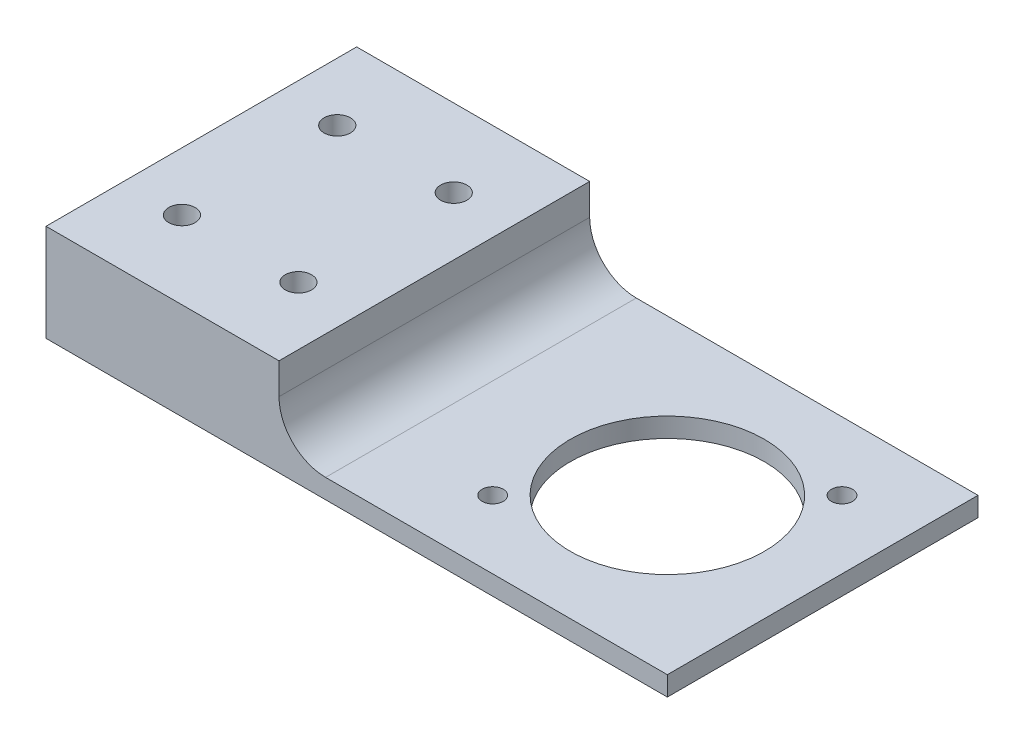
from build123d import *

# Parameters (mm, degrees)
BOSS_EXTRUDE1_DEPTH                         = 3.175
SKETCH6_W                                   = 38.1
SKETCH6_H                                   = 50.8
BOSS_EXTRUDE3_DEPTH                         = 12.7
FILLET1_R                                   = 7.62
SKETCH7_R                                   = 2.15265
CUT_EXTRUDE4_DEPTH                          = 15.875
THRUHOLEFOR1_180_BEARINGOD_REACH            = 72.21
SKETCH8_R                                   = 15.875
TAPPEDHOLEFOR8_32_BOLTMUSTBE_375_LONG_REACH = 72.21
SKETCH9_R                                   = 1.7272


with BuildPart() as part:
    # Sketch1 → Boss-Extrude1 (new body)
    with BuildSketch(Plane(origin=(0, 0, 0), x_dir=(1, 0, 0), z_dir=(0, 1, 0))):
        Polygon((50.8, 25.4), (63.5, 25.4), (63.5, -25.4), (50.8, -25.4), (0, -25.4), (-38.1, -25.4), (-38.1, 25.4), (0, 25.4), align=None)
    extrude(amount=BOSS_EXTRUDE1_DEPTH)

    # Sketch6 → Boss-Extrude3 (add)
    with BuildSketch(Plane(origin=(0, 3.175, 0), x_dir=(1, 0, 0), z_dir=(0, 1, 0))):
        with Locations((-19.05, 0)):
            Rectangle(SKETCH6_W, SKETCH6_H)
    extrude(amount=BOSS_EXTRUDE3_DEPTH)

    # Fillet1
    fillet1_edges = [part.edges().sort_by_distance(p)[0] for p in [
        (0, 3.175, 0),
    ]]
    fillet(fillet1_edges, radius=FILLET1_R)

    # Sketch7 → Cut-Extrude4 (cut)
    with BuildSketch(Plane.XZ):
        with Locations(Location((-9.525, -12.7, 0), (0, 0, 90))):
            Circle(SKETCH7_R)
        with Locations(Location((-28.575, -12.7, 0), (0, 0, 90))):
            Circle(SKETCH7_R)
        with Locations(Location((-9.525, 12.7, 0), (0, 0, 270))):
            Circle(SKETCH7_R)
        with Locations(Location((-28.575, 12.7, 0), (0, 0, 270))):
            Circle(SKETCH7_R)
    extrude(amount=-CUT_EXTRUDE4_DEPTH, mode=Mode.SUBTRACT)

    # Sketch8 → ThruHoleFor1.180_BearingOD (cut, up to next)
    with BuildSketch(Plane.XZ, mode=Mode.PRIVATE) as thruholefor1_180_bearingod_sk1:
        with Locations(Location((38.1, 0, 0), (0, 0, 270))):
            Circle(SKETCH8_R)
    thruholefor1_180_bearingod_tool1 = extrude(thruholefor1_180_bearingod_sk1.sketch, amount=-THRUHOLEFOR1_180_BEARINGOD_REACH, mode=Mode.PRIVATE) & part.part
    add(thruholefor1_180_bearingod_tool1.solids().sort_by_distance((38.1, 0, 0))[0], mode=Mode.SUBTRACT)

    # Sketch9 → TappedHoleFor8-32_BoltMustBe.375_Long (cut, up to next)
    with BuildSketch(Plane.XZ, mode=Mode.PRIVATE) as tappedholefor8_32_boltmustbe_375_long_sk1:
        with Locations(Location((52.378607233, -14.278607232, 0), (0, 0, 270))):
            Circle(SKETCH9_R)
    tappedholefor8_32_boltmustbe_375_long_tool1 = extrude(tappedholefor8_32_boltmustbe_375_long_sk1.sketch, amount=-TAPPEDHOLEFOR8_32_BOLTMUSTBE_375_LONG_REACH, mode=Mode.PRIVATE) & part.part
    # Sketch9 → TappedHoleFor8-32_BoltMustBe.375_Long (cut, up to next)
    with BuildSketch(Plane.XZ, mode=Mode.PRIVATE) as tappedholefor8_32_boltmustbe_375_long_sk2:
        with Locations(Location((23.821392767, 14.278607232, 0), (0, 0, 270))):
            Circle(SKETCH9_R)
    tappedholefor8_32_boltmustbe_375_long_tool2 = extrude(tappedholefor8_32_boltmustbe_375_long_sk2.sketch, amount=-TAPPEDHOLEFOR8_32_BOLTMUSTBE_375_LONG_REACH, mode=Mode.PRIVATE) & part.part
    add(tappedholefor8_32_boltmustbe_375_long_tool1.solids().sort_by_distance((52.378607, 0, -14.278607))[0], mode=Mode.SUBTRACT)
    add(tappedholefor8_32_boltmustbe_375_long_tool2.solids().sort_by_distance((23.821393, 0, 14.278607))[0], mode=Mode.SUBTRACT)


solid = part.part
